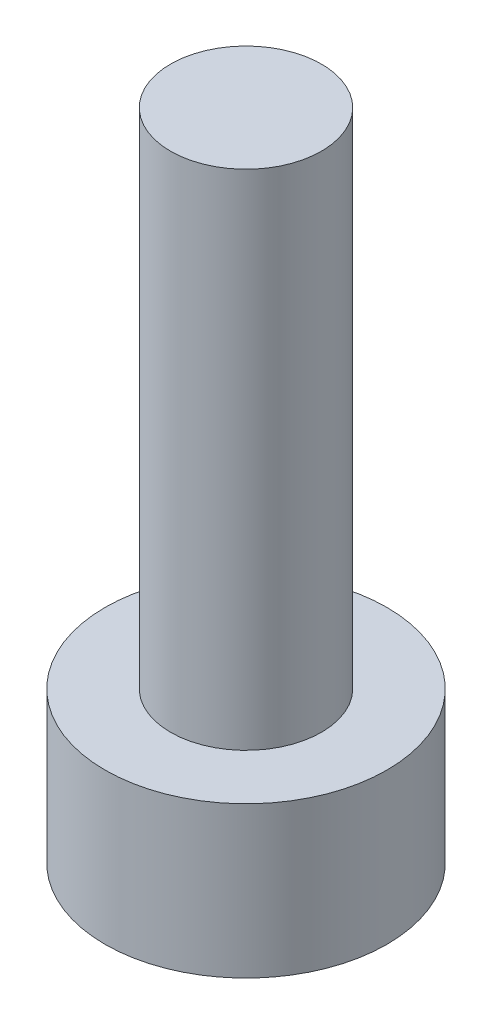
from build123d import *

# Parameters (mm, degrees)
SKETCH_1_R          = 2.8
EXTRUDE_1_DEPTH     = 3
SKETCH_2_R          = 1.5
EXTRUDE_2_DEPTH     = 10
CUT_EXTRUDE_1_DEPTH = 1.5


with BuildPart() as part:
    # Sketch 1 → Extrude 1 (new body)
    with BuildSketch(Plane(origin=(0, 0, 0), x_dir=(1, 0, 0), z_dir=(0, 1, 0))):
        with Locations(Location((0, 0, 0), (0, 0, 270))):
            Circle(SKETCH_1_R)
    extrude(amount=EXTRUDE_1_DEPTH)

    # Sketch 2 → Extrude 2 (add)
    with BuildSketch(Plane(origin=(0, 3, 0), x_dir=(1, 0, 0), z_dir=(0, 1, 0))):
        with Locations(Location((0, 0, 0), (0, 0, 270))):
            Circle(SKETCH_2_R)
    extrude(amount=EXTRUDE_2_DEPTH)

    # Sketch 3 → Cut-Extrude 1 (cut)
    with BuildSketch(Plane.XZ):
        Polygon((1.084583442, -0.952371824), (1.367069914, 0.463090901), (0.282486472, 1.415462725), (-1.084583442, 0.952371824), (-1.367069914, -0.463090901), (-0.282486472, -1.415462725), align=None)
    extrude(amount=-CUT_EXTRUDE_1_DEPTH, mode=Mode.SUBTRACT)


solid = part.part
